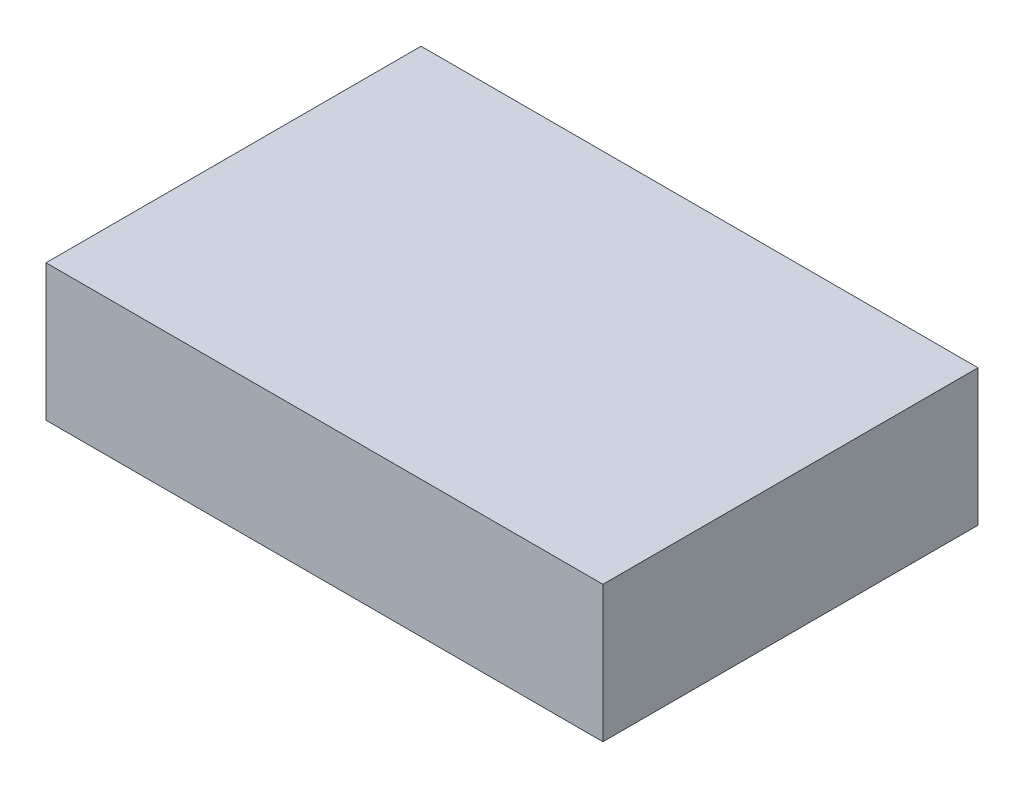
from build123d import *

# Parameters (mm, degrees)
SKETCH1_W           = 49
SKETCH1_H           = 33
BOSS_EXTRUDE1_DEPTH = 12


with BuildPart() as part:
    # Sketch1 → Boss-Extrude1 (new body)
    with BuildSketch(Plane(origin=(0, 0, 0), x_dir=(1, 0, 0), z_dir=(0, 1, 0))):
        Rectangle(SKETCH1_W, SKETCH1_H)
    extrude(amount=BOSS_EXTRUDE1_DEPTH)


solid = part.part
